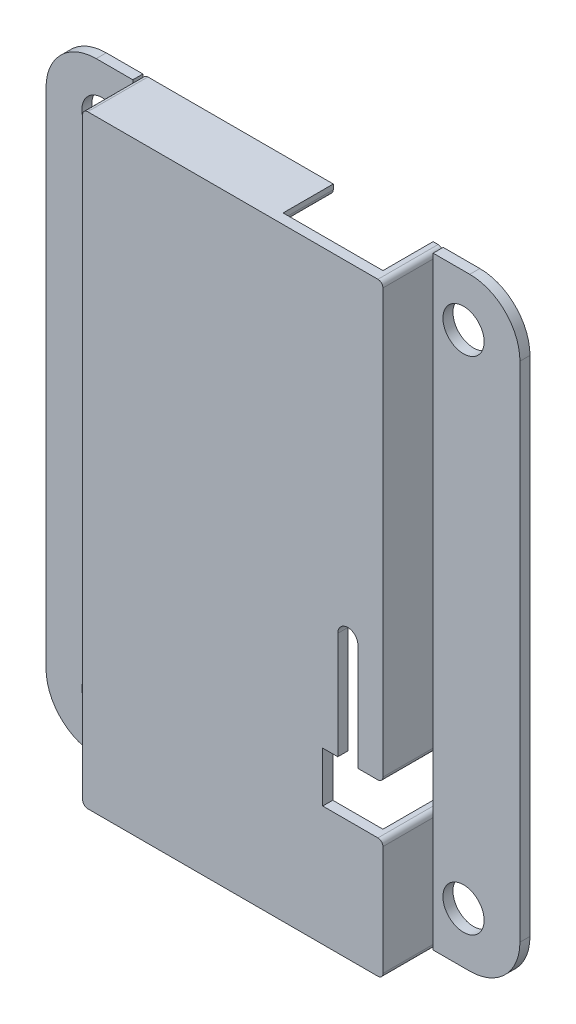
from build123d import *

# Parameters (mm, degrees)
BOSS_EXTRUDE2_DEPTH = 3.048
SHELL2_T            = -0.508
SKETCH10_W          = 5.054342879
SKETCH10_H          = 2.54
CUT_EXTRUDE1_DEPTH  = 30.048111
FILLET2_R           = 0.254
SKETCH11_R          = 1.04267733
BOSS_EXTRUDE3_DEPTH = 0.508


with BuildPart() as part:
    # Sketch8 → Boss-Extrude2 (new body)
    with BuildSketch(Plane.XY):
        with BuildLine():
            Line((6.331179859, -6.670820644), (7.599956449, -6.670820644))
            Line((7.599956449, -6.670820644), (7.599956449, 15.278055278))
            Line((7.599956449, 15.278055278), (-7.599956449, 15.278055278))
            Line((-7.599956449, 15.278055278), (-7.599956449, -15.278055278))
            Line((-7.599956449, -15.278055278), (7.599956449, -15.278055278))
            Line((7.599956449, -15.278055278), (7.599956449, -9.210820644))
            Line((7.599956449, -9.210820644), (4.551956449, -9.210820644))
            Line((4.551956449, -9.210820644), (4.551956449, -6.670820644))
            Line((4.551956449, -6.670820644), (5.315179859, -6.670820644))
            Line((5.315179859, -6.670820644), (5.315179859, -1.255954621))
            ThreePointArc((5.315179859, -1.255954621), (5.823179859, -0.747954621), (6.331179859, -1.255954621))
            Line((6.331179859, -1.255954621), (6.331179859, -6.670820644))
        make_face()
    extrude(amount=BOSS_EXTRUDE2_DEPTH)

    # Shell2
    shell2_openings = [part.faces().sort_by_distance(p)[0] for p in [
        (-0.180647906, 0.185677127, 0),
    ]]
    offset(amount=SHELL2_T, openings=shell2_openings, kind=Kind.INTERSECTION)

    # Sketch10 → Cut-Extrude1 (cut)
    with BuildSketch(Plane(origin=(0, 15.278055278, 0), x_dir=(1, 0, 0), z_dir=(0, 1, 0))):
        with Locations((4.56478501, -1.27)):
            Rectangle(SKETCH10_W, SKETCH10_H)
    extrude(amount=-CUT_EXTRUDE1_DEPTH, mode=Mode.SUBTRACT)

    # Fillet2
    fillet2_edges = [part.edges().sort_by_distance(p)[0] for p in [
        (7.599956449, -6.670820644, 1.524),
        (7.599956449, -9.210820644, 1.524),
        (7.599956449, -15.278055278, 1.524),
        (-7.599956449, -15.278055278, 1.524),
        (-7.599956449, 15.278055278, 1.524),
        (7.599956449, 15.278055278, 1.524),
        (2.03761357, 14.770055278, 1.27),
    ]]
    fillet(fillet2_edges, radius=FILLET2_R)

    # Sketch11 → Boss-Extrude3 (add)
    with BuildSketch(Plane.XY):
        with BuildLine():
            Line((-11.994494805, 12.740867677), (-11.994494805, -12.729101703))
            ThreePointArc((-11.994494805, -12.729101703), (-11.250546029, -14.525152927), (-9.454494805, -15.269101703))
            Line((-9.454494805, -15.269101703), (-7.599956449, -15.269101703))
            Line((-7.599956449, -15.269101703), (-7.599956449, 15.280867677))
            Line((-7.599956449, 15.280867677), (-9.454494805, 15.280867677))
            ThreePointArc((-9.454494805, 15.280867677), (-11.250546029, 14.536918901), (-11.994494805, 12.740867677))
        make_face()
        with Locations((-9.138739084, 12.680906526)):
            Circle(SKETCH11_R, mode=Mode.SUBTRACT)
        with Locations((-9.138739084, -12.680906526)):
            Circle(SKETCH11_R, mode=Mode.SUBTRACT)
    boss_extrude3 = extrude(amount=BOSS_EXTRUDE3_DEPTH)

    # Mirror1: Boss-Extrude3 across plane
    add(boss_extrude3.mirror(Plane(origin=(0, 0, 0), x_dir=(0, 0, 1), z_dir=(1, 0, 0))))


solid = part.part
